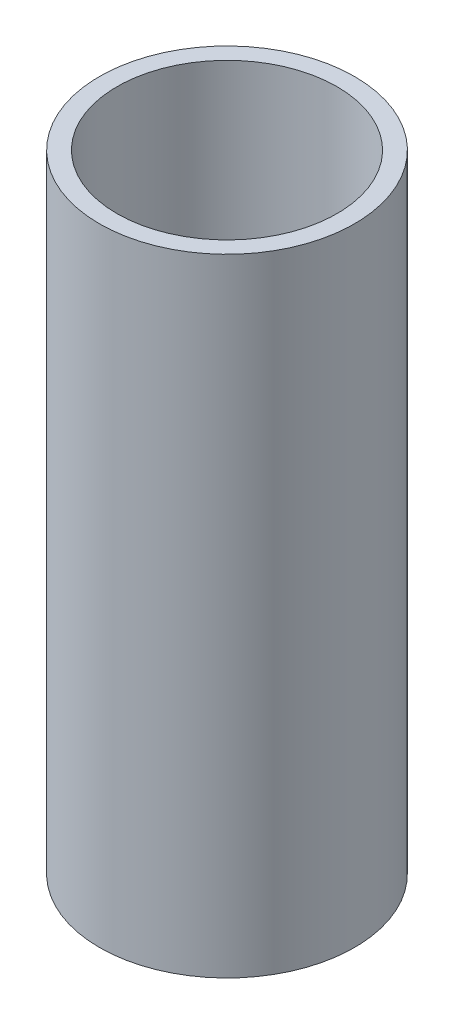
from build123d import *

# Parameters (mm, degrees)
SKETCH1_R      = 36.449
SKETCH1_R_2    = 31.4325
EXTRUDE1_DEPTH = 179.07


with BuildPart() as part:
    # Sketch1 → Extrude1 (new body)
    with BuildSketch(Plane(origin=(0, 0, 0), x_dir=(1, 0, 0), z_dir=(0, 1, 0))):
        with Locations(Location((0, 0, 0), (0, 0, 270))):
            Circle(SKETCH1_R)
        with Locations(Location((0, 0, 0), (0, 0, 270))):
            Circle(SKETCH1_R_2, mode=Mode.SUBTRACT)
    extrude(amount=EXTRUDE1_DEPTH)


solid = part.part
